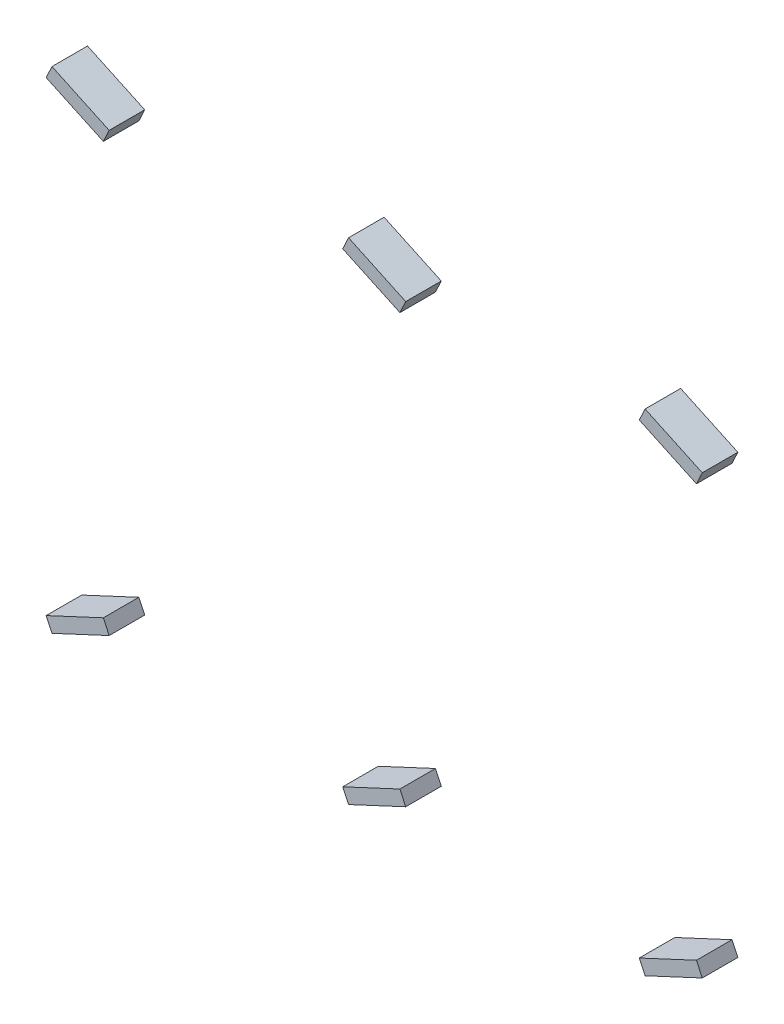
ISO-10303-21;
HEADER;
FILE_DESCRIPTION(('STEP AP214'),'2;1');
FILE_NAME('part.step','',(''),(''),'','','');
FILE_SCHEMA(('AUTOMOTIVE_DESIGN { 1 0 10303 214 1 1 1 1 }'));
ENDSEC;
DATA;
#1=APPLICATION_CONTEXT('core data for automotive mechanical design processes');
#2=APPLICATION_PROTOCOL_DEFINITION('international standard','automotive_design',2000,#1);
#3=PRODUCT_CONTEXT('',#1,'mechanical');
#4=PRODUCT('Part','Part','',(#3));
#5=PRODUCT_RELATED_PRODUCT_CATEGORY('part','',(#4));
#6=PRODUCT_DEFINITION_FORMATION('','',#4);
#7=PRODUCT_DEFINITION_CONTEXT('part definition',#1,'design');
#8=PRODUCT_DEFINITION('design','',#6,#7);
#9=PRODUCT_DEFINITION_SHAPE('','',#8);
#10=(LENGTH_UNIT() NAMED_UNIT(*) SI_UNIT(.MILLI.,.METRE.));
#11=(NAMED_UNIT(*) PLANE_ANGLE_UNIT() SI_UNIT($,.RADIAN.));
#12=(NAMED_UNIT(*) SI_UNIT($,.STERADIAN.) SOLID_ANGLE_UNIT());
#13=UNCERTAINTY_MEASURE_WITH_UNIT(LENGTH_MEASURE(1.E-05),#10,'distance_accuracy_value','');
#14=(GEOMETRIC_REPRESENTATION_CONTEXT(3) GLOBAL_UNCERTAINTY_ASSIGNED_CONTEXT((#13)) GLOBAL_UNIT_ASSIGNED_CONTEXT((#10,
#11,#12)) REPRESENTATION_CONTEXT('',''));
#15=CARTESIAN_POINT('',(0.,0.,0.));
#16=DIRECTION('',(0.,0.,1.));
#17=DIRECTION('',(1.,0.,0.));
#18=AXIS2_PLACEMENT_3D('',#15,#16,#17);
#19=CARTESIAN_POINT('',(19.63112152,12.01818526,-3.09999888));
#20=DIRECTION('',(0.422618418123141,-0.906307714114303,0.));
#21=DIRECTION('',(0.906307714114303,0.422618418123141,0.));
#22=AXIS2_PLACEMENT_3D('',#19,#20,#21);
#23=PLANE('',#22);
#24=DIRECTION('',(0.,0.,1.));
#25=VECTOR('',#24,1.);
#26=CARTESIAN_POINT('',(14.64643248,9.69378554,-3.09999888));
#27=LINE('',#26,#25);
#28=CARTESIAN_POINT('',(14.6464324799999,9.69378554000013,-3.09999888));
#29=VERTEX_POINT('',#28);
#30=CARTESIAN_POINT('',(14.6464324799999,9.69378554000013,0.));
#31=VERTEX_POINT('',#30);
#32=EDGE_CURVE('P0_E20',#29,#31,#27,.T.);
#33=ORIENTED_EDGE('',*,*,#32,.T.);
#34=DIRECTION('',(0.90630771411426,0.422618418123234,0.));
#35=VECTOR('',#34,1.);
#36=CARTESIAN_POINT('',(14.64643248,9.69378554,0.));
#37=LINE('',#36,#35);
#38=CARTESIAN_POINT('',(19.63112152,12.01818526,0.));
#39=VERTEX_POINT('',#38);
#40=EDGE_CURVE('P0_E55',#31,#39,#37,.T.);
#41=ORIENTED_EDGE('',*,*,#40,.T.);
#42=DIRECTION('',(0.,0.,1.));
#43=VECTOR('',#42,1.);
#44=CARTESIAN_POINT('',(19.6311215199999,12.01818526,-3.09999888));
#45=LINE('',#44,#43);
#46=CARTESIAN_POINT('',(19.63112152,12.01818526,-3.09999888));
#47=VERTEX_POINT('',#46);
#48=EDGE_CURVE('P0_E76',#39,#47,#45,.F.);
#49=ORIENTED_EDGE('',*,*,#48,.T.);
#50=DIRECTION('',(0.90630771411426,0.422618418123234,0.));
#51=VECTOR('',#50,1.);
#52=CARTESIAN_POINT('',(14.64643248,9.69378554,-3.09999888));
#53=LINE('',#52,#51);
#54=EDGE_CURVE('P0_E58',#29,#47,#53,.T.);
#55=ORIENTED_EDGE('',*,*,#54,.F.);
#56=EDGE_LOOP('',(#33,#41,#49,#55));
#57=FACE_BOUND('',#56,.T.);
#58=ADVANCED_FACE('P0_F17',(#57),#23,.F.);
#59=CARTESIAN_POINT('',(14.64643248,9.69378554,-3.09999888));
#60=DIRECTION('',(0.906308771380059,0.422616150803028,0.));
#61=DIRECTION('',(-0.422616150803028,0.906308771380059,0.));
#62=AXIS2_PLACEMENT_3D('',#59,#60,#61);
#63=PLANE('',#62);
#64=DIRECTION('',(0.,0.,1.));
#65=VECTOR('',#64,1.);
#66=CARTESIAN_POINT('',(15.15357142,8.60621596,-3.09999888));
#67=LINE('',#66,#65);
#68=CARTESIAN_POINT('',(15.1535714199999,8.60621595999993,-3.09999888));
#69=VERTEX_POINT('',#68);
#70=CARTESIAN_POINT('',(15.1535714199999,8.60621595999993,0.));
#71=VERTEX_POINT('',#70);
#72=EDGE_CURVE('P0_E73',#69,#71,#67,.T.);
#73=ORIENTED_EDGE('',*,*,#72,.T.);
#74=DIRECTION('',(-0.422616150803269,0.906308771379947,0.));
#75=VECTOR('',#74,1.);
#76=CARTESIAN_POINT('',(15.15357142,8.60621596,0.));
#77=LINE('',#76,#75);
#78=EDGE_CURVE('P0_E63',#71,#31,#77,.T.);
#79=ORIENTED_EDGE('',*,*,#78,.T.);
#80=ORIENTED_EDGE('',*,*,#32,.F.);
#81=DIRECTION('',(-0.422616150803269,0.906308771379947,0.));
#82=VECTOR('',#81,1.);
#83=CARTESIAN_POINT('',(15.15357142,8.60621596,-3.09999888));
#84=LINE('',#83,#82);
#85=EDGE_CURVE('P0_E78',#69,#29,#84,.T.);
#86=ORIENTED_EDGE('',*,*,#85,.F.);
#87=EDGE_LOOP('',(#73,#79,#80,#86));
#88=FACE_BOUND('',#87,.T.);
#89=ADVANCED_FACE('P0_F72',(#88),#63,.F.);
#90=CARTESIAN_POINT('',(15.15357142,8.60621596,0.));
#91=DIRECTION('',(0.,0.,-1.));
#92=DIRECTION('',(-1.,0.,0.));
#93=AXIS2_PLACEMENT_3D('',#90,#91,#92);
#94=PLANE('',#93);
#95=DIRECTION('',(0.42261881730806,-0.906307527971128,0.));
#96=VECTOR('',#95,1.);
#97=CARTESIAN_POINT('',(20.13826554,10.93061314,0.));
#98=LINE('',#97,#96);
#99=CARTESIAN_POINT('',(20.1382655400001,10.9306131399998,0.));
#100=VERTEX_POINT('',#99);
#101=EDGE_CURVE('P0_E69',#100,#39,#98,.F.);
#102=ORIENTED_EDGE('',*,*,#101,.T.);
#103=ORIENTED_EDGE('',*,*,#40,.F.);
#104=ORIENTED_EDGE('',*,*,#78,.F.);
#105=DIRECTION('',(-0.90630805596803,-0.422617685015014,0.));
#106=VECTOR('',#105,1.);
#107=CARTESIAN_POINT('',(15.15357142,8.60621596,0.));
#108=LINE('',#107,#106);
#109=EDGE_CURVE('P0_E83',#71,#100,#108,.F.);
#110=ORIENTED_EDGE('',*,*,#109,.T.);
#111=EDGE_LOOP('',(#102,#103,#104,#110));
#112=FACE_BOUND('',#111,.T.);
#113=ADVANCED_FACE('P0_F66',(#112),#94,.F.);
#114=CARTESIAN_POINT('',(20.13826554,10.93061314,-3.09999888));
#115=DIRECTION('',(-0.906307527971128,-0.42261881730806,0.));
#116=DIRECTION('',(0.42261881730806,-0.906307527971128,0.));
#117=AXIS2_PLACEMENT_3D('',#114,#115,#116);
#118=PLANE('',#117);
#119=ORIENTED_EDGE('',*,*,#48,.F.);
#120=ORIENTED_EDGE('',*,*,#101,.F.);
#121=DIRECTION('',(0.,0.,1.));
#122=VECTOR('',#121,1.);
#123=CARTESIAN_POINT('',(20.1382655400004,10.9306131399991,-3.09999888));
#124=LINE('',#123,#122);
#125=CARTESIAN_POINT('',(20.1382655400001,10.9306131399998,-3.09999888));
#126=VERTEX_POINT('',#125);
#127=EDGE_CURVE('P0_E26',#100,#126,#124,.F.);
#128=ORIENTED_EDGE('',*,*,#127,.T.);
#129=DIRECTION('',(0.422618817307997,-0.906307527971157,0.));
#130=VECTOR('',#129,1.);
#131=CARTESIAN_POINT('',(19.63112152,12.01818526,-3.09999888));
#132=LINE('',#131,#130);
#133=EDGE_CURVE('P0_E34',#47,#126,#132,.T.);
#134=ORIENTED_EDGE('',*,*,#133,.F.);
#135=EDGE_LOOP('',(#119,#120,#128,#134));
#136=FACE_BOUND('',#135,.T.);
#137=ADVANCED_FACE('P0_F88',(#136),#118,.F.);
#138=CARTESIAN_POINT('',(15.15357142,8.60621596,-3.09999888));
#139=DIRECTION('',(0.,0.,-1.));
#140=DIRECTION('',(-1.,0.,0.));
#141=AXIS2_PLACEMENT_3D('',#138,#139,#140);
#142=PLANE('',#141);
#143=ORIENTED_EDGE('',*,*,#133,.T.);
#144=DIRECTION('',(-0.90630805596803,-0.422617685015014,0.));
#145=VECTOR('',#144,1.);
#146=CARTESIAN_POINT('',(15.15357142,8.60621596,-3.09999888));
#147=LINE('',#146,#145);
#148=EDGE_CURVE('P0_E11',#126,#69,#147,.T.);
#149=ORIENTED_EDGE('',*,*,#148,.T.);
#150=ORIENTED_EDGE('',*,*,#85,.T.);
#151=ORIENTED_EDGE('',*,*,#54,.T.);
#152=EDGE_LOOP('',(#143,#149,#150,#151));
#153=FACE_BOUND('',#152,.T.);
#154=ADVANCED_FACE('P0_F91',(#153),#142,.T.);
#155=CARTESIAN_POINT('',(15.15357142,8.60621596,-3.09999888));
#156=DIRECTION('',(-0.422617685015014,0.90630805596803,0.));
#157=DIRECTION('',(-0.90630805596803,-0.422617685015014,0.));
#158=AXIS2_PLACEMENT_3D('',#155,#156,#157);
#159=PLANE('',#158);
#160=ORIENTED_EDGE('',*,*,#127,.F.);
#161=ORIENTED_EDGE('',*,*,#109,.F.);
#162=ORIENTED_EDGE('',*,*,#72,.F.);
#163=ORIENTED_EDGE('',*,*,#148,.F.);
#164=EDGE_LOOP('',(#160,#161,#162,#163));
#165=FACE_BOUND('',#164,.T.);
#166=ADVANCED_FACE('P0_F90',(#165),#159,.F.);
#167=CLOSED_SHELL('',(#58,#89,#113,#137,#154,#166));
#168=MANIFOLD_SOLID_BREP('P0_B1',#167);
#169=CARTESIAN_POINT('',(15.1535765,51.39378342,-3.09999888));
#170=DIRECTION('',(0.422618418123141,0.906307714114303,0.));
#171=DIRECTION('',(-0.906307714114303,0.422618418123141,0.));
#172=AXIS2_PLACEMENT_3D('',#169,#170,#171);
#173=PLANE('',#172);
#174=DIRECTION('',(0.,0.,1.));
#175=VECTOR('',#174,1.);
#176=CARTESIAN_POINT('',(20.13826554,49.0693837,-3.09999888));
#177=LINE('',#176,#175);
#178=CARTESIAN_POINT('',(20.1382655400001,49.0693837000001,-3.09999888));
#179=VERTEX_POINT('',#178);
#180=CARTESIAN_POINT('',(20.1382655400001,49.0693837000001,0.));
#181=VERTEX_POINT('',#180);
#182=EDGE_CURVE('P1_E20',#179,#181,#177,.T.);
#183=ORIENTED_EDGE('',*,*,#182,.F.);
#184=DIRECTION('',(-0.90630771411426,0.422618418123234,0.));
#185=VECTOR('',#184,1.);
#186=CARTESIAN_POINT('',(20.13826554,49.0693837,-3.09999888));
#187=LINE('',#186,#185);
#188=CARTESIAN_POINT('',(15.1535765,51.39378342,-3.09999888));
#189=VERTEX_POINT('',#188);
#190=EDGE_CURVE('P1_E80',#179,#189,#187,.T.);
#191=ORIENTED_EDGE('',*,*,#190,.T.);
#192=DIRECTION('',(0.,0.,1.));
#193=VECTOR('',#192,1.);
#194=CARTESIAN_POINT('',(15.1535765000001,51.39378342,-3.09999888));
#195=LINE('',#194,#193);
#196=CARTESIAN_POINT('',(15.1535765,51.39378342,0.));
#197=VERTEX_POINT('',#196);
#198=EDGE_CURVE('P1_E68',#197,#189,#195,.F.);
#199=ORIENTED_EDGE('',*,*,#198,.F.);
#200=DIRECTION('',(-0.90630771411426,0.422618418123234,0.));
#201=VECTOR('',#200,1.);
#202=CARTESIAN_POINT('',(20.13826554,49.0693837,0.));
#203=LINE('',#202,#201);
#204=EDGE_CURVE('P1_E56',#181,#197,#203,.T.);
#205=ORIENTED_EDGE('',*,*,#204,.F.);
#206=EDGE_LOOP('',(#183,#191,#199,#205));
#207=FACE_BOUND('',#206,.T.);
#208=ADVANCED_FACE('P1_F17',(#207),#173,.T.);
#209=CARTESIAN_POINT('',(20.13826554,49.0693837,-3.09999888));
#210=DIRECTION('',(0.906308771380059,-0.422616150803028,0.));
#211=DIRECTION('',(0.422616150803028,0.906308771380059,0.));
#212=AXIS2_PLACEMENT_3D('',#209,#210,#211);
#213=PLANE('',#212);
#214=DIRECTION('',(0.,0.,1.));
#215=VECTOR('',#214,1.);
#216=CARTESIAN_POINT('',(19.6311266,47.98181412,-3.09999888));
#217=LINE('',#216,#215);
#218=CARTESIAN_POINT('',(19.6311266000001,47.9818141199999,-3.09999888));
#219=VERTEX_POINT('',#218);
#220=CARTESIAN_POINT('',(19.6311266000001,47.9818141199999,0.));
#221=VERTEX_POINT('',#220);
#222=EDGE_CURVE('P1_E83',#219,#221,#217,.T.);
#223=ORIENTED_EDGE('',*,*,#222,.F.);
#224=DIRECTION('',(0.422616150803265,0.906308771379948,0.));
#225=VECTOR('',#224,1.);
#226=CARTESIAN_POINT('',(19.6311266,47.98181412,-3.09999888));
#227=LINE('',#226,#225);
#228=EDGE_CURVE('P1_E65',#219,#179,#227,.T.);
#229=ORIENTED_EDGE('',*,*,#228,.T.);
#230=ORIENTED_EDGE('',*,*,#182,.T.);
#231=DIRECTION('',(0.422616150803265,0.906308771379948,0.));
#232=VECTOR('',#231,1.);
#233=CARTESIAN_POINT('',(19.6311266,47.98181412,0.));
#234=LINE('',#233,#232);
#235=EDGE_CURVE('P1_E62',#221,#181,#234,.T.);
#236=ORIENTED_EDGE('',*,*,#235,.F.);
#237=EDGE_LOOP('',(#223,#229,#230,#236));
#238=FACE_BOUND('',#237,.T.);
#239=ADVANCED_FACE('P1_F61',(#238),#213,.T.);
#240=CARTESIAN_POINT('',(19.6311266,47.98181412,0.));
#241=DIRECTION('',(0.,0.,1.));
#242=DIRECTION('',(1.,0.,0.));
#243=AXIS2_PLACEMENT_3D('',#240,#241,#242);
#244=PLANE('',#243);
#245=DIRECTION('',(-0.42261881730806,-0.906307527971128,0.));
#246=VECTOR('',#245,1.);
#247=CARTESIAN_POINT('',(14.64643248,50.3062113,0.));
#248=LINE('',#247,#246);
#249=CARTESIAN_POINT('',(14.6464324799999,50.3062112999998,0.));
#250=VERTEX_POINT('',#249);
#251=EDGE_CURVE('P1_E70',#250,#197,#248,.F.);
#252=ORIENTED_EDGE('',*,*,#251,.F.);
#253=DIRECTION('',(0.90630805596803,-0.422617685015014,0.));
#254=VECTOR('',#253,1.);
#255=CARTESIAN_POINT('',(19.6311266,47.98181412,0.));
#256=LINE('',#255,#254);
#257=EDGE_CURVE('P1_E74',#221,#250,#256,.F.);
#258=ORIENTED_EDGE('',*,*,#257,.F.);
#259=ORIENTED_EDGE('',*,*,#235,.T.);
#260=ORIENTED_EDGE('',*,*,#204,.T.);
#261=EDGE_LOOP('',(#252,#258,#259,#260));
#262=FACE_BOUND('',#261,.T.);
#263=ADVANCED_FACE('P1_F72',(#262),#244,.T.);
#264=CARTESIAN_POINT('',(14.64643248,50.3062113,-3.09999888));
#265=DIRECTION('',(-0.906307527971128,0.42261881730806,0.));
#266=DIRECTION('',(-0.42261881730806,-0.906307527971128,0.));
#267=AXIS2_PLACEMENT_3D('',#264,#265,#266);
#268=PLANE('',#267);
#269=ORIENTED_EDGE('',*,*,#198,.T.);
#270=DIRECTION('',(-0.422618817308,-0.906307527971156,0.));
#271=VECTOR('',#270,1.);
#272=CARTESIAN_POINT('',(15.1535765,51.39378342,-3.09999888));
#273=LINE('',#272,#271);
#274=CARTESIAN_POINT('',(14.6464324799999,50.3062112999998,-3.09999888));
#275=VERTEX_POINT('',#274);
#276=EDGE_CURVE('P1_E35',#189,#275,#273,.T.);
#277=ORIENTED_EDGE('',*,*,#276,.T.);
#278=DIRECTION('',(0.,0.,1.));
#279=VECTOR('',#278,1.);
#280=CARTESIAN_POINT('',(14.6464324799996,50.3062112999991,-3.09999888));
#281=LINE('',#280,#279);
#282=EDGE_CURVE('P1_E26',#250,#275,#281,.F.);
#283=ORIENTED_EDGE('',*,*,#282,.F.);
#284=ORIENTED_EDGE('',*,*,#251,.T.);
#285=EDGE_LOOP('',(#269,#277,#283,#284));
#286=FACE_BOUND('',#285,.T.);
#287=ADVANCED_FACE('P1_F89',(#286),#268,.T.);
#288=CARTESIAN_POINT('',(19.6311266,47.98181412,-3.09999888));
#289=DIRECTION('',(0.,0.,1.));
#290=DIRECTION('',(1.,0.,0.));
#291=AXIS2_PLACEMENT_3D('',#288,#289,#290);
#292=PLANE('',#291);
#293=ORIENTED_EDGE('',*,*,#276,.F.);
#294=ORIENTED_EDGE('',*,*,#190,.F.);
#295=ORIENTED_EDGE('',*,*,#228,.F.);
#296=DIRECTION('',(0.90630805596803,-0.422617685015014,0.));
#297=VECTOR('',#296,1.);
#298=CARTESIAN_POINT('',(19.6311266,47.98181412,-3.09999888));
#299=LINE('',#298,#297);
#300=EDGE_CURVE('P1_E11',#275,#219,#299,.T.);
#301=ORIENTED_EDGE('',*,*,#300,.F.);
#302=EDGE_LOOP('',(#293,#294,#295,#301));
#303=FACE_BOUND('',#302,.T.);
#304=ADVANCED_FACE('P1_F91',(#303),#292,.F.);
#305=CARTESIAN_POINT('',(19.6311266,47.98181412,-3.09999888));
#306=DIRECTION('',(-0.422617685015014,-0.90630805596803,0.));
#307=DIRECTION('',(0.90630805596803,-0.422617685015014,0.));
#308=AXIS2_PLACEMENT_3D('',#305,#306,#307);
#309=PLANE('',#308);
#310=ORIENTED_EDGE('',*,*,#282,.T.);
#311=ORIENTED_EDGE('',*,*,#300,.T.);
#312=ORIENTED_EDGE('',*,*,#222,.T.);
#313=ORIENTED_EDGE('',*,*,#257,.T.);
#314=EDGE_LOOP('',(#310,#311,#312,#313));
#315=FACE_BOUND('',#314,.T.);
#316=ADVANCED_FACE('P1_F88',(#315),#309,.T.);
#317=CLOSED_SHELL('',(#208,#239,#263,#287,#304,#316));
#318=MANIFOLD_SOLID_BREP('P1_B1',#317);
#319=CARTESIAN_POINT('',(45.48112316,12.01818526,-3.09999888));
#320=DIRECTION('',(0.422618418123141,-0.906307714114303,0.));
#321=DIRECTION('',(0.906307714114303,0.422618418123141,0.));
#322=AXIS2_PLACEMENT_3D('',#319,#320,#321);
#323=PLANE('',#322);
#324=DIRECTION('',(0.,0.,1.));
#325=VECTOR('',#324,1.);
#326=CARTESIAN_POINT('',(40.49643412,9.69378554,-3.09999888));
#327=LINE('',#326,#325);
#328=CARTESIAN_POINT('',(40.49643412,9.69378554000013,-3.09999888));
#329=VERTEX_POINT('',#328);
#330=CARTESIAN_POINT('',(40.49643412,9.69378554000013,0.));
#331=VERTEX_POINT('',#330);
#332=EDGE_CURVE('P2_E20',#329,#331,#327,.T.);
#333=ORIENTED_EDGE('',*,*,#332,.T.);
#334=DIRECTION('',(0.90630771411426,0.422618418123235,0.));
#335=VECTOR('',#334,1.);
#336=CARTESIAN_POINT('',(40.49643412,9.69378554,0.));
#337=LINE('',#336,#335);
#338=CARTESIAN_POINT('',(45.48112316,12.01818526,0.));
#339=VERTEX_POINT('',#338);
#340=EDGE_CURVE('P2_E55',#331,#339,#337,.T.);
#341=ORIENTED_EDGE('',*,*,#340,.T.);
#342=DIRECTION('',(0.,0.,1.));
#343=VECTOR('',#342,1.);
#344=CARTESIAN_POINT('',(45.4811231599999,12.01818526,-3.09999888));
#345=LINE('',#344,#343);
#346=CARTESIAN_POINT('',(45.48112316,12.01818526,-3.09999888));
#347=VERTEX_POINT('',#346);
#348=EDGE_CURVE('P2_E76',#339,#347,#345,.F.);
#349=ORIENTED_EDGE('',*,*,#348,.T.);
#350=DIRECTION('',(0.90630771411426,0.422618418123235,0.));
#351=VECTOR('',#350,1.);
#352=CARTESIAN_POINT('',(40.49643412,9.69378554,-3.09999888));
#353=LINE('',#352,#351);
#354=EDGE_CURVE('P2_E58',#329,#347,#353,.T.);
#355=ORIENTED_EDGE('',*,*,#354,.F.);
#356=EDGE_LOOP('',(#333,#341,#349,#355));
#357=FACE_BOUND('',#356,.T.);
#358=ADVANCED_FACE('P2_F17',(#357),#323,.F.);
#359=CARTESIAN_POINT('',(40.49643412,9.69378554,-3.09999888));
#360=DIRECTION('',(0.906308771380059,0.422616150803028,0.));
#361=DIRECTION('',(-0.422616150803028,0.906308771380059,0.));
#362=AXIS2_PLACEMENT_3D('',#359,#360,#361);
#363=PLANE('',#362);
#364=DIRECTION('',(0.,0.,1.));
#365=VECTOR('',#364,1.);
#366=CARTESIAN_POINT('',(41.00357306,8.60621596,-3.09999888));
#367=LINE('',#366,#365);
#368=CARTESIAN_POINT('',(41.0035730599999,8.60621595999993,-3.09999888));
#369=VERTEX_POINT('',#368);
#370=CARTESIAN_POINT('',(41.0035730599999,8.60621595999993,0.));
#371=VERTEX_POINT('',#370);
#372=EDGE_CURVE('P2_E73',#369,#371,#367,.T.);
#373=ORIENTED_EDGE('',*,*,#372,.T.);
#374=DIRECTION('',(-0.422616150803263,0.906308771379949,0.));
#375=VECTOR('',#374,1.);
#376=CARTESIAN_POINT('',(41.00357306,8.60621596,0.));
#377=LINE('',#376,#375);
#378=EDGE_CURVE('P2_E63',#371,#331,#377,.T.);
#379=ORIENTED_EDGE('',*,*,#378,.T.);
#380=ORIENTED_EDGE('',*,*,#332,.F.);
#381=DIRECTION('',(-0.422616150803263,0.906308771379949,0.));
#382=VECTOR('',#381,1.);
#383=CARTESIAN_POINT('',(41.00357306,8.60621596,-3.09999888));
#384=LINE('',#383,#382);
#385=EDGE_CURVE('P2_E78',#369,#329,#384,.T.);
#386=ORIENTED_EDGE('',*,*,#385,.F.);
#387=EDGE_LOOP('',(#373,#379,#380,#386));
#388=FACE_BOUND('',#387,.T.);
#389=ADVANCED_FACE('P2_F72',(#388),#363,.F.);
#390=CARTESIAN_POINT('',(41.00357306,8.60621596,0.));
#391=DIRECTION('',(0.,0.,-1.));
#392=DIRECTION('',(-1.,0.,0.));
#393=AXIS2_PLACEMENT_3D('',#390,#391,#392);
#394=PLANE('',#393);
#395=DIRECTION('',(0.42261881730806,-0.906307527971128,0.));
#396=VECTOR('',#395,1.);
#397=CARTESIAN_POINT('',(45.98826718,10.93061314,0.));
#398=LINE('',#397,#396);
#399=CARTESIAN_POINT('',(45.9882671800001,10.9306131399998,0.));
#400=VERTEX_POINT('',#399);
#401=EDGE_CURVE('P2_E69',#400,#339,#398,.F.);
#402=ORIENTED_EDGE('',*,*,#401,.T.);
#403=ORIENTED_EDGE('',*,*,#340,.F.);
#404=ORIENTED_EDGE('',*,*,#378,.F.);
#405=DIRECTION('',(-0.90630805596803,-0.422617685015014,0.));
#406=VECTOR('',#405,1.);
#407=CARTESIAN_POINT('',(41.00357306,8.60621596,0.));
#408=LINE('',#407,#406);
#409=EDGE_CURVE('P2_E83',#371,#400,#408,.F.);
#410=ORIENTED_EDGE('',*,*,#409,.T.);
#411=EDGE_LOOP('',(#402,#403,#404,#410));
#412=FACE_BOUND('',#411,.T.);
#413=ADVANCED_FACE('P2_F66',(#412),#394,.F.);
#414=CARTESIAN_POINT('',(45.98826718,10.93061314,-3.09999888));
#415=DIRECTION('',(-0.906307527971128,-0.42261881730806,0.));
#416=DIRECTION('',(0.42261881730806,-0.906307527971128,0.));
#417=AXIS2_PLACEMENT_3D('',#414,#415,#416);
#418=PLANE('',#417);
#419=ORIENTED_EDGE('',*,*,#348,.F.);
#420=ORIENTED_EDGE('',*,*,#401,.F.);
#421=DIRECTION('',(0.,0.,1.));
#422=VECTOR('',#421,1.);
#423=CARTESIAN_POINT('',(45.9882671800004,10.9306131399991,-3.09999888));
#424=LINE('',#423,#422);
#425=CARTESIAN_POINT('',(45.9882671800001,10.9306131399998,-3.09999888));
#426=VERTEX_POINT('',#425);
#427=EDGE_CURVE('P2_E26',#400,#426,#424,.F.);
#428=ORIENTED_EDGE('',*,*,#427,.T.);
#429=DIRECTION('',(0.422618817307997,-0.906307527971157,0.));
#430=VECTOR('',#429,1.);
#431=CARTESIAN_POINT('',(45.48112316,12.01818526,-3.09999888));
#432=LINE('',#431,#430);
#433=EDGE_CURVE('P2_E34',#347,#426,#432,.T.);
#434=ORIENTED_EDGE('',*,*,#433,.F.);
#435=EDGE_LOOP('',(#419,#420,#428,#434));
#436=FACE_BOUND('',#435,.T.);
#437=ADVANCED_FACE('P2_F88',(#436),#418,.F.);
#438=CARTESIAN_POINT('',(41.00357306,8.60621596,-3.09999888));
#439=DIRECTION('',(0.,0.,-1.));
#440=DIRECTION('',(-1.,0.,0.));
#441=AXIS2_PLACEMENT_3D('',#438,#439,#440);
#442=PLANE('',#441);
#443=ORIENTED_EDGE('',*,*,#433,.T.);
#444=DIRECTION('',(-0.90630805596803,-0.422617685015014,0.));
#445=VECTOR('',#444,1.);
#446=CARTESIAN_POINT('',(41.00357306,8.60621596,-3.09999888));
#447=LINE('',#446,#445);
#448=EDGE_CURVE('P2_E11',#426,#369,#447,.T.);
#449=ORIENTED_EDGE('',*,*,#448,.T.);
#450=ORIENTED_EDGE('',*,*,#385,.T.);
#451=ORIENTED_EDGE('',*,*,#354,.T.);
#452=EDGE_LOOP('',(#443,#449,#450,#451));
#453=FACE_BOUND('',#452,.T.);
#454=ADVANCED_FACE('P2_F91',(#453),#442,.T.);
#455=CARTESIAN_POINT('',(41.00357306,8.60621596,-3.09999888));
#456=DIRECTION('',(-0.422617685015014,0.90630805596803,0.));
#457=DIRECTION('',(-0.90630805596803,-0.422617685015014,0.));
#458=AXIS2_PLACEMENT_3D('',#455,#456,#457);
#459=PLANE('',#458);
#460=ORIENTED_EDGE('',*,*,#427,.F.);
#461=ORIENTED_EDGE('',*,*,#409,.F.);
#462=ORIENTED_EDGE('',*,*,#372,.F.);
#463=ORIENTED_EDGE('',*,*,#448,.F.);
#464=EDGE_LOOP('',(#460,#461,#462,#463));
#465=FACE_BOUND('',#464,.T.);
#466=ADVANCED_FACE('P2_F90',(#465),#459,.F.);
#467=CLOSED_SHELL('',(#358,#389,#413,#437,#454,#466));
#468=MANIFOLD_SOLID_BREP('P2_B1',#467);
#469=CARTESIAN_POINT('',(71.33111464,12.01818526,-3.09999888));
#470=DIRECTION('',(0.422618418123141,-0.906307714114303,0.));
#471=DIRECTION('',(0.906307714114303,0.422618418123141,0.));
#472=AXIS2_PLACEMENT_3D('',#469,#470,#471);
#473=PLANE('',#472);
#474=DIRECTION('',(0.,0.,1.));
#475=VECTOR('',#474,1.);
#476=CARTESIAN_POINT('',(66.3464256,9.69378554,-3.09999888));
#477=LINE('',#476,#475);
#478=CARTESIAN_POINT('',(66.3464255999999,9.69378554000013,-3.09999888));
#479=VERTEX_POINT('',#478);
#480=CARTESIAN_POINT('',(66.3464255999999,9.69378554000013,0.));
#481=VERTEX_POINT('',#480);
#482=EDGE_CURVE('P3_E20',#479,#481,#477,.T.);
#483=ORIENTED_EDGE('',*,*,#482,.T.);
#484=DIRECTION('',(0.90630771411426,0.422618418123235,0.));
#485=VECTOR('',#484,1.);
#486=CARTESIAN_POINT('',(66.3464256,9.69378554,0.));
#487=LINE('',#486,#485);
#488=CARTESIAN_POINT('',(71.33111464,12.01818526,0.));
#489=VERTEX_POINT('',#488);
#490=EDGE_CURVE('P3_E55',#481,#489,#487,.T.);
#491=ORIENTED_EDGE('',*,*,#490,.T.);
#492=DIRECTION('',(0.,0.,1.));
#493=VECTOR('',#492,1.);
#494=CARTESIAN_POINT('',(71.3311146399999,12.01818526,-3.09999888));
#495=LINE('',#494,#493);
#496=CARTESIAN_POINT('',(71.33111464,12.01818526,-3.09999888));
#497=VERTEX_POINT('',#496);
#498=EDGE_CURVE('P3_E76',#489,#497,#495,.F.);
#499=ORIENTED_EDGE('',*,*,#498,.T.);
#500=DIRECTION('',(0.90630771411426,0.422618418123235,0.));
#501=VECTOR('',#500,1.);
#502=CARTESIAN_POINT('',(66.3464256,9.69378554,-3.09999888));
#503=LINE('',#502,#501);
#504=EDGE_CURVE('P3_E58',#479,#497,#503,.T.);
#505=ORIENTED_EDGE('',*,*,#504,.F.);
#506=EDGE_LOOP('',(#483,#491,#499,#505));
#507=FACE_BOUND('',#506,.T.);
#508=ADVANCED_FACE('P3_F17',(#507),#473,.F.);
#509=CARTESIAN_POINT('',(66.3464256,9.69378554,-3.09999888));
#510=DIRECTION('',(0.906308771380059,0.422616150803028,0.));
#511=DIRECTION('',(-0.422616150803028,0.906308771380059,0.));
#512=AXIS2_PLACEMENT_3D('',#509,#510,#511);
#513=PLANE('',#512);
#514=DIRECTION('',(0.,0.,1.));
#515=VECTOR('',#514,1.);
#516=CARTESIAN_POINT('',(66.85356454,8.60621596,-3.09999888));
#517=LINE('',#516,#515);
#518=CARTESIAN_POINT('',(66.8535645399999,8.60621595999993,-3.09999888));
#519=VERTEX_POINT('',#518);
#520=CARTESIAN_POINT('',(66.8535645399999,8.60621595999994,0.));
#521=VERTEX_POINT('',#520);
#522=EDGE_CURVE('P3_E73',#519,#521,#517,.T.);
#523=ORIENTED_EDGE('',*,*,#522,.T.);
#524=DIRECTION('',(-0.422616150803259,0.906308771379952,0.));
#525=VECTOR('',#524,1.);
#526=CARTESIAN_POINT('',(66.85356454,8.60621596,0.));
#527=LINE('',#526,#525);
#528=EDGE_CURVE('P3_E63',#521,#481,#527,.T.);
#529=ORIENTED_EDGE('',*,*,#528,.T.);
#530=ORIENTED_EDGE('',*,*,#482,.F.);
#531=DIRECTION('',(-0.422616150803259,0.906308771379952,0.));
#532=VECTOR('',#531,1.);
#533=CARTESIAN_POINT('',(66.85356454,8.60621596,-3.09999888));
#534=LINE('',#533,#532);
#535=EDGE_CURVE('P3_E78',#519,#479,#534,.T.);
#536=ORIENTED_EDGE('',*,*,#535,.F.);
#537=EDGE_LOOP('',(#523,#529,#530,#536));
#538=FACE_BOUND('',#537,.T.);
#539=ADVANCED_FACE('P3_F72',(#538),#513,.F.);
#540=CARTESIAN_POINT('',(66.85356454,8.60621596,0.));
#541=DIRECTION('',(0.,0.,-1.));
#542=DIRECTION('',(-1.,0.,0.));
#543=AXIS2_PLACEMENT_3D('',#540,#541,#542);
#544=PLANE('',#543);
#545=DIRECTION('',(0.42261881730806,-0.906307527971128,0.));
#546=VECTOR('',#545,1.);
#547=CARTESIAN_POINT('',(71.83825866,10.93061314,0.));
#548=LINE('',#547,#546);
#549=CARTESIAN_POINT('',(71.8382586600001,10.9306131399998,0.));
#550=VERTEX_POINT('',#549);
#551=EDGE_CURVE('P3_E69',#550,#489,#548,.F.);
#552=ORIENTED_EDGE('',*,*,#551,.T.);
#553=ORIENTED_EDGE('',*,*,#490,.F.);
#554=ORIENTED_EDGE('',*,*,#528,.F.);
#555=DIRECTION('',(-0.90630805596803,-0.422617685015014,0.));
#556=VECTOR('',#555,1.);
#557=CARTESIAN_POINT('',(66.85356454,8.60621596,0.));
#558=LINE('',#557,#556);
#559=EDGE_CURVE('P3_E83',#521,#550,#558,.F.);
#560=ORIENTED_EDGE('',*,*,#559,.T.);
#561=EDGE_LOOP('',(#552,#553,#554,#560));
#562=FACE_BOUND('',#561,.T.);
#563=ADVANCED_FACE('P3_F66',(#562),#544,.F.);
#564=CARTESIAN_POINT('',(71.83825866,10.93061314,-3.09999888));
#565=DIRECTION('',(-0.906307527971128,-0.42261881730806,0.));
#566=DIRECTION('',(0.42261881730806,-0.906307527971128,0.));
#567=AXIS2_PLACEMENT_3D('',#564,#565,#566);
#568=PLANE('',#567);
#569=ORIENTED_EDGE('',*,*,#498,.F.);
#570=ORIENTED_EDGE('',*,*,#551,.F.);
#571=DIRECTION('',(0.,0.,1.));
#572=VECTOR('',#571,1.);
#573=CARTESIAN_POINT('',(71.8382586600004,10.9306131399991,-3.09999888));
#574=LINE('',#573,#572);
#575=CARTESIAN_POINT('',(71.8382586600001,10.9306131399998,-3.09999888));
#576=VERTEX_POINT('',#575);
#577=EDGE_CURVE('P3_E26',#550,#576,#574,.F.);
#578=ORIENTED_EDGE('',*,*,#577,.T.);
#579=DIRECTION('',(0.422618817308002,-0.906307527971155,0.));
#580=VECTOR('',#579,1.);
#581=CARTESIAN_POINT('',(71.33111464,12.01818526,-3.09999888));
#582=LINE('',#581,#580);
#583=EDGE_CURVE('P3_E34',#497,#576,#582,.T.);
#584=ORIENTED_EDGE('',*,*,#583,.F.);
#585=EDGE_LOOP('',(#569,#570,#578,#584));
#586=FACE_BOUND('',#585,.T.);
#587=ADVANCED_FACE('P3_F88',(#586),#568,.F.);
#588=CARTESIAN_POINT('',(66.85356454,8.60621596,-3.09999888));
#589=DIRECTION('',(0.,0.,-1.));
#590=DIRECTION('',(-1.,0.,0.));
#591=AXIS2_PLACEMENT_3D('',#588,#589,#590);
#592=PLANE('',#591);
#593=ORIENTED_EDGE('',*,*,#583,.T.);
#594=DIRECTION('',(-0.90630805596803,-0.422617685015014,0.));
#595=VECTOR('',#594,1.);
#596=CARTESIAN_POINT('',(66.85356454,8.60621596,-3.09999888));
#597=LINE('',#596,#595);
#598=EDGE_CURVE('P3_E11',#576,#519,#597,.T.);
#599=ORIENTED_EDGE('',*,*,#598,.T.);
#600=ORIENTED_EDGE('',*,*,#535,.T.);
#601=ORIENTED_EDGE('',*,*,#504,.T.);
#602=EDGE_LOOP('',(#593,#599,#600,#601));
#603=FACE_BOUND('',#602,.T.);
#604=ADVANCED_FACE('P3_F91',(#603),#592,.T.);
#605=CARTESIAN_POINT('',(66.85356454,8.60621596,-3.09999888));
#606=DIRECTION('',(-0.422617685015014,0.90630805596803,0.));
#607=DIRECTION('',(-0.90630805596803,-0.422617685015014,0.));
#608=AXIS2_PLACEMENT_3D('',#605,#606,#607);
#609=PLANE('',#608);
#610=ORIENTED_EDGE('',*,*,#577,.F.);
#611=ORIENTED_EDGE('',*,*,#559,.F.);
#612=ORIENTED_EDGE('',*,*,#522,.F.);
#613=ORIENTED_EDGE('',*,*,#598,.F.);
#614=EDGE_LOOP('',(#610,#611,#612,#613));
#615=FACE_BOUND('',#614,.T.);
#616=ADVANCED_FACE('P3_F90',(#615),#609,.F.);
#617=CLOSED_SHELL('',(#508,#539,#563,#587,#604,#616));
#618=MANIFOLD_SOLID_BREP('P3_B1',#617);
#619=CARTESIAN_POINT('',(66.85356962,51.39378342,-3.09999888));
#620=DIRECTION('',(0.422618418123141,0.906307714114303,0.));
#621=DIRECTION('',(-0.906307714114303,0.422618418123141,0.));
#622=AXIS2_PLACEMENT_3D('',#619,#620,#621);
#623=PLANE('',#622);
#624=DIRECTION('',(0.,0.,1.));
#625=VECTOR('',#624,1.);
#626=CARTESIAN_POINT('',(71.83825866,49.0693837,-3.09999888));
#627=LINE('',#626,#625);
#628=CARTESIAN_POINT('',(71.8382586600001,49.0693837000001,-3.09999888));
#629=VERTEX_POINT('',#628);
#630=CARTESIAN_POINT('',(71.8382586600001,49.0693837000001,0.));
#631=VERTEX_POINT('',#630);
#632=EDGE_CURVE('P4_E20',#629,#631,#627,.T.);
#633=ORIENTED_EDGE('',*,*,#632,.F.);
#634=DIRECTION('',(-0.90630771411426,0.422618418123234,0.));
#635=VECTOR('',#634,1.);
#636=CARTESIAN_POINT('',(71.83825866,49.0693837,-3.09999888));
#637=LINE('',#636,#635);
#638=CARTESIAN_POINT('',(66.85356962,51.39378342,-3.09999888));
#639=VERTEX_POINT('',#638);
#640=EDGE_CURVE('P4_E80',#629,#639,#637,.T.);
#641=ORIENTED_EDGE('',*,*,#640,.T.);
#642=DIRECTION('',(0.,0.,1.));
#643=VECTOR('',#642,1.);
#644=CARTESIAN_POINT('',(66.8535696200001,51.39378342,-3.09999888));
#645=LINE('',#644,#643);
#646=CARTESIAN_POINT('',(66.85356962,51.39378342,0.));
#647=VERTEX_POINT('',#646);
#648=EDGE_CURVE('P4_E68',#647,#639,#645,.F.);
#649=ORIENTED_EDGE('',*,*,#648,.F.);
#650=DIRECTION('',(-0.90630771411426,0.422618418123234,0.));
#651=VECTOR('',#650,1.);
#652=CARTESIAN_POINT('',(71.83825866,49.0693837,0.));
#653=LINE('',#652,#651);
#654=EDGE_CURVE('P4_E56',#631,#647,#653,.T.);
#655=ORIENTED_EDGE('',*,*,#654,.F.);
#656=EDGE_LOOP('',(#633,#641,#649,#655));
#657=FACE_BOUND('',#656,.T.);
#658=ADVANCED_FACE('P4_F17',(#657),#623,.T.);
#659=CARTESIAN_POINT('',(71.83825866,49.0693837,-3.09999888));
#660=DIRECTION('',(0.906308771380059,-0.422616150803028,0.));
#661=DIRECTION('',(0.422616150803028,0.906308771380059,0.));
#662=AXIS2_PLACEMENT_3D('',#659,#660,#661);
#663=PLANE('',#662);
#664=DIRECTION('',(0.,0.,1.));
#665=VECTOR('',#664,1.);
#666=CARTESIAN_POINT('',(71.33111972,47.98181412,-3.09999888));
#667=LINE('',#666,#665);
#668=CARTESIAN_POINT('',(71.3311197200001,47.9818141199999,-3.09999888));
#669=VERTEX_POINT('',#668);
#670=CARTESIAN_POINT('',(71.3311197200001,47.9818141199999,0.));
#671=VERTEX_POINT('',#670);
#672=EDGE_CURVE('P4_E83',#669,#671,#667,.T.);
#673=ORIENTED_EDGE('',*,*,#672,.F.);
#674=DIRECTION('',(0.422616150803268,0.906308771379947,0.));
#675=VECTOR('',#674,1.);
#676=CARTESIAN_POINT('',(71.33111972,47.98181412,-3.09999888));
#677=LINE('',#676,#675);
#678=EDGE_CURVE('P4_E65',#669,#629,#677,.T.);
#679=ORIENTED_EDGE('',*,*,#678,.T.);
#680=ORIENTED_EDGE('',*,*,#632,.T.);
#681=DIRECTION('',(0.422616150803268,0.906308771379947,0.));
#682=VECTOR('',#681,1.);
#683=CARTESIAN_POINT('',(71.33111972,47.98181412,0.));
#684=LINE('',#683,#682);
#685=EDGE_CURVE('P4_E62',#671,#631,#684,.T.);
#686=ORIENTED_EDGE('',*,*,#685,.F.);
#687=EDGE_LOOP('',(#673,#679,#680,#686));
#688=FACE_BOUND('',#687,.T.);
#689=ADVANCED_FACE('P4_F61',(#688),#663,.T.);
#690=CARTESIAN_POINT('',(71.33111972,47.98181412,0.));
#691=DIRECTION('',(0.,0.,1.));
#692=DIRECTION('',(1.,0.,0.));
#693=AXIS2_PLACEMENT_3D('',#690,#691,#692);
#694=PLANE('',#693);
#695=DIRECTION('',(-0.42261881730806,-0.906307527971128,0.));
#696=VECTOR('',#695,1.);
#697=CARTESIAN_POINT('',(66.3464256,50.3062113,0.));
#698=LINE('',#697,#696);
#699=CARTESIAN_POINT('',(66.3464255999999,50.3062112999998,0.));
#700=VERTEX_POINT('',#699);
#701=EDGE_CURVE('P4_E70',#700,#647,#698,.F.);
#702=ORIENTED_EDGE('',*,*,#701,.F.);
#703=DIRECTION('',(0.90630805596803,-0.422617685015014,0.));
#704=VECTOR('',#703,1.);
#705=CARTESIAN_POINT('',(71.33111972,47.98181412,0.));
#706=LINE('',#705,#704);
#707=EDGE_CURVE('P4_E74',#671,#700,#706,.F.);
#708=ORIENTED_EDGE('',*,*,#707,.F.);
#709=ORIENTED_EDGE('',*,*,#685,.T.);
#710=ORIENTED_EDGE('',*,*,#654,.T.);
#711=EDGE_LOOP('',(#702,#708,#709,#710));
#712=FACE_BOUND('',#711,.T.);
#713=ADVANCED_FACE('P4_F72',(#712),#694,.T.);
#714=CARTESIAN_POINT('',(66.3464256,50.3062113,-3.09999888));
#715=DIRECTION('',(-0.906307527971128,0.42261881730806,0.));
#716=DIRECTION('',(-0.42261881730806,-0.906307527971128,0.));
#717=AXIS2_PLACEMENT_3D('',#714,#715,#716);
#718=PLANE('',#717);
#719=ORIENTED_EDGE('',*,*,#648,.T.);
#720=DIRECTION('',(-0.422618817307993,-0.906307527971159,0.));
#721=VECTOR('',#720,1.);
#722=CARTESIAN_POINT('',(66.85356962,51.39378342,-3.09999888));
#723=LINE('',#722,#721);
#724=CARTESIAN_POINT('',(66.3464255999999,50.3062112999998,-3.09999888));
#725=VERTEX_POINT('',#724);
#726=EDGE_CURVE('P4_E35',#639,#725,#723,.T.);
#727=ORIENTED_EDGE('',*,*,#726,.T.);
#728=DIRECTION('',(0.,0.,1.));
#729=VECTOR('',#728,1.);
#730=CARTESIAN_POINT('',(66.3464255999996,50.3062112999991,-3.09999888));
#731=LINE('',#730,#729);
#732=EDGE_CURVE('P4_E26',#700,#725,#731,.F.);
#733=ORIENTED_EDGE('',*,*,#732,.F.);
#734=ORIENTED_EDGE('',*,*,#701,.T.);
#735=EDGE_LOOP('',(#719,#727,#733,#734));
#736=FACE_BOUND('',#735,.T.);
#737=ADVANCED_FACE('P4_F89',(#736),#718,.T.);
#738=CARTESIAN_POINT('',(71.33111972,47.98181412,-3.09999888));
#739=DIRECTION('',(0.,0.,1.));
#740=DIRECTION('',(1.,0.,0.));
#741=AXIS2_PLACEMENT_3D('',#738,#739,#740);
#742=PLANE('',#741);
#743=ORIENTED_EDGE('',*,*,#726,.F.);
#744=ORIENTED_EDGE('',*,*,#640,.F.);
#745=ORIENTED_EDGE('',*,*,#678,.F.);
#746=DIRECTION('',(0.90630805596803,-0.422617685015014,0.));
#747=VECTOR('',#746,1.);
#748=CARTESIAN_POINT('',(71.33111972,47.98181412,-3.09999888));
#749=LINE('',#748,#747);
#750=EDGE_CURVE('P4_E11',#725,#669,#749,.T.);
#751=ORIENTED_EDGE('',*,*,#750,.F.);
#752=EDGE_LOOP('',(#743,#744,#745,#751));
#753=FACE_BOUND('',#752,.T.);
#754=ADVANCED_FACE('P4_F91',(#753),#742,.F.);
#755=CARTESIAN_POINT('',(71.33111972,47.98181412,-3.09999888));
#756=DIRECTION('',(-0.422617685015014,-0.90630805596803,0.));
#757=DIRECTION('',(0.90630805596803,-0.422617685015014,0.));
#758=AXIS2_PLACEMENT_3D('',#755,#756,#757);
#759=PLANE('',#758);
#760=ORIENTED_EDGE('',*,*,#732,.T.);
#761=ORIENTED_EDGE('',*,*,#750,.T.);
#762=ORIENTED_EDGE('',*,*,#672,.T.);
#763=ORIENTED_EDGE('',*,*,#707,.T.);
#764=EDGE_LOOP('',(#760,#761,#762,#763));
#765=FACE_BOUND('',#764,.T.);
#766=ADVANCED_FACE('P4_F88',(#765),#759,.T.);
#767=CLOSED_SHELL('',(#658,#689,#713,#737,#754,#766));
#768=MANIFOLD_SOLID_BREP('P4_B1',#767);
#769=CARTESIAN_POINT('',(41.00357814,51.39378342,-3.09999888));
#770=DIRECTION('',(0.422618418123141,0.906307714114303,0.));
#771=DIRECTION('',(-0.906307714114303,0.422618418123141,0.));
#772=AXIS2_PLACEMENT_3D('',#769,#770,#771);
#773=PLANE('',#772);
#774=DIRECTION('',(0.,0.,1.));
#775=VECTOR('',#774,1.);
#776=CARTESIAN_POINT('',(45.98826718,49.0693837,-3.09999888));
#777=LINE('',#776,#775);
#778=CARTESIAN_POINT('',(45.9882671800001,49.0693837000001,-3.09999888));
#779=VERTEX_POINT('',#778);
#780=CARTESIAN_POINT('',(45.9882671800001,49.0693837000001,0.));
#781=VERTEX_POINT('',#780);
#782=EDGE_CURVE('P5_E20',#779,#781,#777,.T.);
#783=ORIENTED_EDGE('',*,*,#782,.F.);
#784=DIRECTION('',(-0.90630771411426,0.422618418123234,0.));
#785=VECTOR('',#784,1.);
#786=CARTESIAN_POINT('',(45.98826718,49.0693837,-3.09999888));
#787=LINE('',#786,#785);
#788=CARTESIAN_POINT('',(41.00357814,51.39378342,-3.09999888));
#789=VERTEX_POINT('',#788);
#790=EDGE_CURVE('P5_E80',#779,#789,#787,.T.);
#791=ORIENTED_EDGE('',*,*,#790,.T.);
#792=DIRECTION('',(0.,0.,1.));
#793=VECTOR('',#792,1.);
#794=CARTESIAN_POINT('',(41.0035781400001,51.39378342,-3.09999888));
#795=LINE('',#794,#793);
#796=CARTESIAN_POINT('',(41.00357814,51.39378342,0.));
#797=VERTEX_POINT('',#796);
#798=EDGE_CURVE('P5_E68',#797,#789,#795,.F.);
#799=ORIENTED_EDGE('',*,*,#798,.F.);
#800=DIRECTION('',(-0.90630771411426,0.422618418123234,0.));
#801=VECTOR('',#800,1.);
#802=CARTESIAN_POINT('',(45.98826718,49.0693837,0.));
#803=LINE('',#802,#801);
#804=EDGE_CURVE('P5_E56',#781,#797,#803,.T.);
#805=ORIENTED_EDGE('',*,*,#804,.F.);
#806=EDGE_LOOP('',(#783,#791,#799,#805));
#807=FACE_BOUND('',#806,.T.);
#808=ADVANCED_FACE('P5_F17',(#807),#773,.T.);
#809=CARTESIAN_POINT('',(45.98826718,49.0693837,-3.09999888));
#810=DIRECTION('',(0.906308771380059,-0.422616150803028,0.));
#811=DIRECTION('',(0.422616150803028,0.906308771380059,0.));
#812=AXIS2_PLACEMENT_3D('',#809,#810,#811);
#813=PLANE('',#812);
#814=DIRECTION('',(0.,0.,1.));
#815=VECTOR('',#814,1.);
#816=CARTESIAN_POINT('',(45.48112824,47.98181412,-3.09999888));
#817=LINE('',#816,#815);
#818=CARTESIAN_POINT('',(45.4811282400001,47.9818141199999,-3.09999888));
#819=VERTEX_POINT('',#818);
#820=CARTESIAN_POINT('',(45.4811282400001,47.9818141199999,0.));
#821=VERTEX_POINT('',#820);
#822=EDGE_CURVE('P5_E83',#819,#821,#817,.T.);
#823=ORIENTED_EDGE('',*,*,#822,.F.);
#824=DIRECTION('',(0.422616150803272,0.906308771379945,0.));
#825=VECTOR('',#824,1.);
#826=CARTESIAN_POINT('',(45.48112824,47.98181412,-3.09999888));
#827=LINE('',#826,#825);
#828=EDGE_CURVE('P5_E65',#819,#779,#827,.T.);
#829=ORIENTED_EDGE('',*,*,#828,.T.);
#830=ORIENTED_EDGE('',*,*,#782,.T.);
#831=DIRECTION('',(0.422616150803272,0.906308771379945,0.));
#832=VECTOR('',#831,1.);
#833=CARTESIAN_POINT('',(45.48112824,47.98181412,0.));
#834=LINE('',#833,#832);
#835=EDGE_CURVE('P5_E62',#821,#781,#834,.T.);
#836=ORIENTED_EDGE('',*,*,#835,.F.);
#837=EDGE_LOOP('',(#823,#829,#830,#836));
#838=FACE_BOUND('',#837,.T.);
#839=ADVANCED_FACE('P5_F61',(#838),#813,.T.);
#840=CARTESIAN_POINT('',(45.48112824,47.98181412,0.));
#841=DIRECTION('',(0.,0.,1.));
#842=DIRECTION('',(1.,0.,0.));
#843=AXIS2_PLACEMENT_3D('',#840,#841,#842);
#844=PLANE('',#843);
#845=DIRECTION('',(-0.42261881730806,-0.906307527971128,0.));
#846=VECTOR('',#845,1.);
#847=CARTESIAN_POINT('',(40.49643412,50.3062113,0.));
#848=LINE('',#847,#846);
#849=CARTESIAN_POINT('',(40.4964341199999,50.3062112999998,0.));
#850=VERTEX_POINT('',#849);
#851=EDGE_CURVE('P5_E70',#850,#797,#848,.F.);
#852=ORIENTED_EDGE('',*,*,#851,.F.);
#853=DIRECTION('',(0.90630805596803,-0.422617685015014,0.));
#854=VECTOR('',#853,1.);
#855=CARTESIAN_POINT('',(45.48112824,47.98181412,0.));
#856=LINE('',#855,#854);
#857=EDGE_CURVE('P5_E74',#821,#850,#856,.F.);
#858=ORIENTED_EDGE('',*,*,#857,.F.);
#859=ORIENTED_EDGE('',*,*,#835,.T.);
#860=ORIENTED_EDGE('',*,*,#804,.T.);
#861=EDGE_LOOP('',(#852,#858,#859,#860));
#862=FACE_BOUND('',#861,.T.);
#863=ADVANCED_FACE('P5_F72',(#862),#844,.T.);
#864=CARTESIAN_POINT('',(40.49643412,50.3062113,-3.09999888));
#865=DIRECTION('',(-0.906307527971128,0.42261881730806,0.));
#866=DIRECTION('',(-0.42261881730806,-0.906307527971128,0.));
#867=AXIS2_PLACEMENT_3D('',#864,#865,#866);
#868=PLANE('',#867);
#869=ORIENTED_EDGE('',*,*,#798,.T.);
#870=DIRECTION('',(-0.422618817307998,-0.906307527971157,0.));
#871=VECTOR('',#870,1.);
#872=CARTESIAN_POINT('',(41.00357814,51.39378342,-3.09999888));
#873=LINE('',#872,#871);
#874=CARTESIAN_POINT('',(40.4964341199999,50.3062112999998,-3.09999888));
#875=VERTEX_POINT('',#874);
#876=EDGE_CURVE('P5_E35',#789,#875,#873,.T.);
#877=ORIENTED_EDGE('',*,*,#876,.T.);
#878=DIRECTION('',(0.,0.,1.));
#879=VECTOR('',#878,1.);
#880=CARTESIAN_POINT('',(40.4964341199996,50.3062112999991,-3.09999888));
#881=LINE('',#880,#879);
#882=EDGE_CURVE('P5_E26',#850,#875,#881,.F.);
#883=ORIENTED_EDGE('',*,*,#882,.F.);
#884=ORIENTED_EDGE('',*,*,#851,.T.);
#885=EDGE_LOOP('',(#869,#877,#883,#884));
#886=FACE_BOUND('',#885,.T.);
#887=ADVANCED_FACE('P5_F89',(#886),#868,.T.);
#888=CARTESIAN_POINT('',(45.48112824,47.98181412,-3.09999888));
#889=DIRECTION('',(0.,0.,1.));
#890=DIRECTION('',(1.,0.,0.));
#891=AXIS2_PLACEMENT_3D('',#888,#889,#890);
#892=PLANE('',#891);
#893=ORIENTED_EDGE('',*,*,#876,.F.);
#894=ORIENTED_EDGE('',*,*,#790,.F.);
#895=ORIENTED_EDGE('',*,*,#828,.F.);
#896=DIRECTION('',(0.90630805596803,-0.422617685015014,0.));
#897=VECTOR('',#896,1.);
#898=CARTESIAN_POINT('',(45.48112824,47.98181412,-3.09999888));
#899=LINE('',#898,#897);
#900=EDGE_CURVE('P5_E11',#875,#819,#899,.T.);
#901=ORIENTED_EDGE('',*,*,#900,.F.);
#902=EDGE_LOOP('',(#893,#894,#895,#901));
#903=FACE_BOUND('',#902,.T.);
#904=ADVANCED_FACE('P5_F91',(#903),#892,.F.);
#905=CARTESIAN_POINT('',(45.48112824,47.98181412,-3.09999888));
#906=DIRECTION('',(-0.422617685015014,-0.90630805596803,0.));
#907=DIRECTION('',(0.90630805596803,-0.422617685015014,0.));
#908=AXIS2_PLACEMENT_3D('',#905,#906,#907);
#909=PLANE('',#908);
#910=ORIENTED_EDGE('',*,*,#882,.T.);
#911=ORIENTED_EDGE('',*,*,#900,.T.);
#912=ORIENTED_EDGE('',*,*,#822,.T.);
#913=ORIENTED_EDGE('',*,*,#857,.T.);
#914=EDGE_LOOP('',(#910,#911,#912,#913));
#915=FACE_BOUND('',#914,.T.);
#916=ADVANCED_FACE('P5_F88',(#915),#909,.T.);
#917=CLOSED_SHELL('',(#808,#839,#863,#887,#904,#916));
#918=MANIFOLD_SOLID_BREP('P5_B1',#917);
#919=ADVANCED_BREP_SHAPE_REPRESENTATION('',(#18,#168,#318,#468,#618,#768,#918),#14);
#920=SHAPE_DEFINITION_REPRESENTATION(#9,#919);
ENDSEC;
END-ISO-10303-21;
